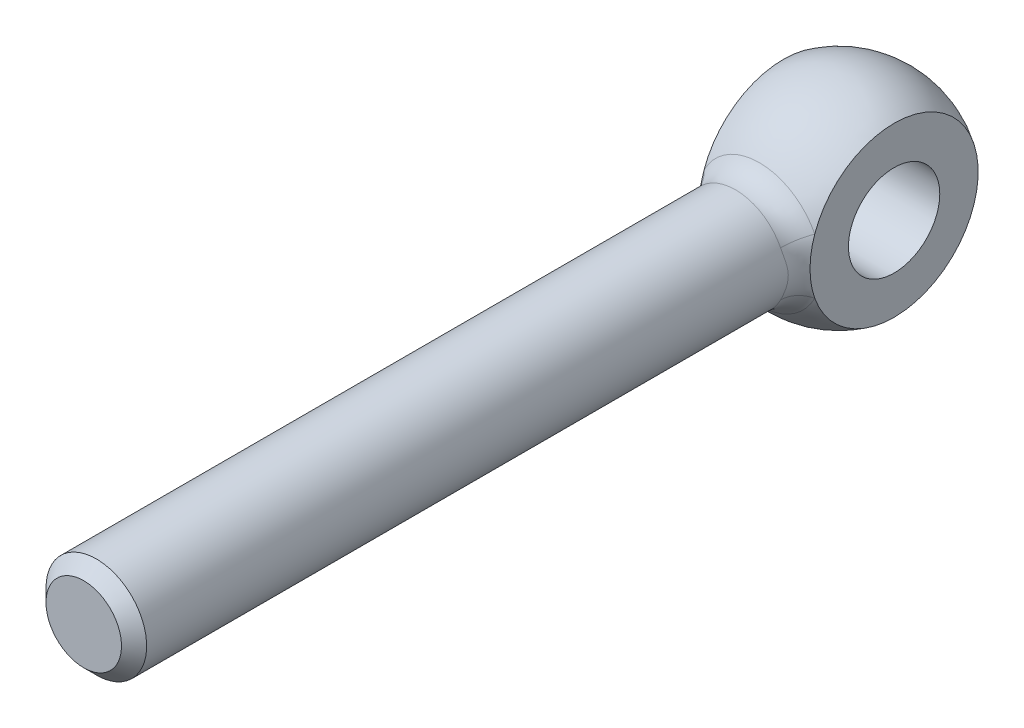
ISO-10303-21;
HEADER;
FILE_DESCRIPTION(('STEP AP214'),'2;1');
FILE_NAME('part.step','',(''),(''),'','','');
FILE_SCHEMA(('AUTOMOTIVE_DESIGN { 1 0 10303 214 1 1 1 1 }'));
ENDSEC;
DATA;
#1=APPLICATION_CONTEXT('core data for automotive mechanical design processes');
#2=APPLICATION_PROTOCOL_DEFINITION('international standard','automotive_design',2000,#1);
#3=PRODUCT_CONTEXT('',#1,'mechanical');
#4=PRODUCT('Part','Part','',(#3));
#5=PRODUCT_RELATED_PRODUCT_CATEGORY('part','',(#4));
#6=PRODUCT_DEFINITION_FORMATION('','',#4);
#7=PRODUCT_DEFINITION_CONTEXT('part definition',#1,'design');
#8=PRODUCT_DEFINITION('design','',#6,#7);
#9=PRODUCT_DEFINITION_SHAPE('','',#8);
#10=(LENGTH_UNIT() NAMED_UNIT(*) SI_UNIT(.MILLI.,.METRE.));
#11=(NAMED_UNIT(*) PLANE_ANGLE_UNIT() SI_UNIT($,.RADIAN.));
#12=(NAMED_UNIT(*) SI_UNIT($,.STERADIAN.) SOLID_ANGLE_UNIT());
#13=UNCERTAINTY_MEASURE_WITH_UNIT(LENGTH_MEASURE(1.E-05),#10,'distance_accuracy_value','');
#14=(GEOMETRIC_REPRESENTATION_CONTEXT(3) GLOBAL_UNCERTAINTY_ASSIGNED_CONTEXT((#13)) GLOBAL_UNIT_ASSIGNED_CONTEXT((#10,
#11,#12)) REPRESENTATION_CONTEXT('',''));
#15=CARTESIAN_POINT('',(0.,0.,0.));
#16=DIRECTION('',(0.,0.,1.));
#17=DIRECTION('',(1.,0.,0.));
#18=AXIS2_PLACEMENT_3D('',#15,#16,#17);
#19=CARTESIAN_POINT('',(0.,0.,0.));
#20=DIRECTION('',(1.,0.,0.));
#21=DIRECTION('',(0.,0.,-1.));
#22=AXIS2_PLACEMENT_3D('',#19,#20,#21);
#23=SPHERICAL_SURFACE('',#22,20.);
#24=CARTESIAN_POINT('',(-11.,0.,0.));
#25=DIRECTION('',(-1.,0.,0.));
#26=DIRECTION('',(0.,0.,1.));
#27=AXIS2_PLACEMENT_3D('',#24,#25,#26);
#28=CIRCLE('',#27,16.70329308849);
#29=CARTESIAN_POINT('',(-11.,-5.52080518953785,15.7645396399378));
#30=VERTEX_POINT('',#29);
#31=CARTESIAN_POINT('',(-11.,5.52080518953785,15.7645396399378));
#32=VERTEX_POINT('',#31);
#33=EDGE_CURVE('E249',#30,#32,#28,.F.);
#34=ORIENTED_EDGE('',*,*,#33,.T.);
#35=CARTESIAN_POINT('',(0.,0.,15.7645396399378));
#36=DIRECTION('',(0.,0.,-1.));
#37=DIRECTION('',(-1.,0.,0.));
#38=AXIS2_PLACEMENT_3D('',#35,#36,#37);
#39=CIRCLE('',#38,12.3076923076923);
#40=CARTESIAN_POINT('',(11.,5.52080518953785,15.7645396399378));
#41=VERTEX_POINT('',#40);
#42=EDGE_CURVE('E72',#32,#41,#39,.T.);
#43=ORIENTED_EDGE('',*,*,#42,.T.);
#44=CARTESIAN_POINT('',(11.,0.,0.));
#45=DIRECTION('',(-1.,0.,0.));
#46=DIRECTION('',(0.,0.,1.));
#47=AXIS2_PLACEMENT_3D('',#44,#45,#46);
#48=CIRCLE('',#47,16.70329308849);
#49=CARTESIAN_POINT('',(11.,-5.52080518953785,15.7645396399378));
#50=VERTEX_POINT('',#49);
#51=EDGE_CURVE('E60',#50,#41,#48,.F.);
#52=ORIENTED_EDGE('',*,*,#51,.F.);
#53=CARTESIAN_POINT('',(0.,0.,15.7645396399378));
#54=DIRECTION('',(0.,0.,-1.));
#55=DIRECTION('',(-1.,0.,0.));
#56=AXIS2_PLACEMENT_3D('',#53,#54,#55);
#57=CIRCLE('',#56,12.3076923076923);
#58=EDGE_CURVE('E69',#50,#30,#57,.T.);
#59=ORIENTED_EDGE('',*,*,#58,.T.);
#60=EDGE_LOOP('',(#34,#43,#52,#59));
#61=FACE_BOUND('',#60,.T.);
#62=ADVANCED_FACE('F14',(#61),#23,.T.);
#63=CARTESIAN_POINT('',(0.,0.,-10.));
#64=DIRECTION('',(0.,0.,-1.));
#65=DIRECTION('',(-1.,0.,0.));
#66=AXIS2_PLACEMENT_3D('',#63,#64,#65);
#67=CYLINDRICAL_SURFACE('',#66,10.);
#68=CARTESIAN_POINT('',(-11.,-8.07832612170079,14.6198716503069));
#69=CARTESIAN_POINT('',(-8.08765755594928,-5.9971977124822,16.1346742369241));
#70=CARTESIAN_POINT('',(-7.28375150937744,-6.8517854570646,19.8401938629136));
#71=CARTESIAN_POINT('',(-11.,-7.94371141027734,14.6942392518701));
#72=CARTESIAN_POINT('',(-8.11920288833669,-5.93544806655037,16.2397826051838));
#73=CARTESIAN_POINT('',(-7.39683409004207,-6.73162150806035,19.9238227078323));
#74=CARTESIAN_POINT('',(-11.,-7.80678493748,14.7674864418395));
#75=CARTESIAN_POINT('',(-8.15519368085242,-5.86983189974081,16.3423149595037));
#76=CARTESIAN_POINT('',(-7.50807818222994,-6.60735770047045,19.9985173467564));
#77=CARTESIAN_POINT('',(-11.,-7.52777860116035,14.9116503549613));
#78=CARTESIAN_POINT('',(-8.23492168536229,-5.72986071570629,16.5404699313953));
#79=CARTESIAN_POINT('',(-7.72578328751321,-6.3514024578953,20.1309394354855));
#80=CARTESIAN_POINT('',(-11.,-7.38570047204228,14.9825678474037));
#81=CARTESIAN_POINT('',(-8.27858235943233,-5.6556001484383,16.6361171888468));
#82=CARTESIAN_POINT('',(-7.83224588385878,-6.2197135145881,20.1886725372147));
#83=CARTESIAN_POINT('',(-11.,-7.09641260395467,15.1217242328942));
#84=CARTESIAN_POINT('',(-8.37244720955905,-5.49738599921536,16.8193360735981));
#85=CARTESIAN_POINT('',(-8.03890108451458,-5.95019585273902,20.2879075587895));
#86=CARTESIAN_POINT('',(-11.,-6.94922832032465,15.1899735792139));
#87=CARTESIAN_POINT('',(-8.42255486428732,-5.41357855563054,16.9069775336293));
#88=CARTESIAN_POINT('',(-8.13911932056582,-5.81239684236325,20.3294800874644));
#89=CARTESIAN_POINT('',(-11.,-6.64863682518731,15.3239259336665));
#90=CARTESIAN_POINT('',(-8.52797993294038,-5.23504745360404,17.0738797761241));
#91=CARTESIAN_POINT('',(-8.3329585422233,-5.5309117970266,20.3979224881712));
#92=CARTESIAN_POINT('',(-11.,-6.49523086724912,15.3896294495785));
#93=CARTESIAN_POINT('',(-8.58324700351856,-5.14042645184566,17.1531990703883));
#94=CARTESIAN_POINT('',(-8.42658084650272,-5.38722694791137,20.4247953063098));
#95=CARTESIAN_POINT('',(-11.,-6.20709411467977,15.5078088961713));
#96=CARTESIAN_POINT('',(-8.68811994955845,-4.95575537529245,17.290828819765));
#97=CARTESIAN_POINT('',(-8.59200338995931,-5.11841729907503,20.4619167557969));
#98=CARTESIAN_POINT('',(-11.,-6.07336532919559,15.5607030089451));
#99=CARTESIAN_POINT('',(-8.73711538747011,-4.8676122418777,17.3504312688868));
#100=CARTESIAN_POINT('',(-8.66488139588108,-4.99405789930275,20.4741536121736));
#101=CARTESIAN_POINT('',(-11.,-5.80091130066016,15.6643118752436));
#102=CARTESIAN_POINT('',(-8.8364756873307,-4.68301353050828,17.4631108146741));
#103=CARTESIAN_POINT('',(-8.80526889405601,-4.74215537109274,20.4901477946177));
#104=CARTESIAN_POINT('',(-11.,-5.66218619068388,15.7150266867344));
#105=CARTESIAN_POINT('',(-8.8868350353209,-4.58660687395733,17.5162358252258));
#106=CARTESIAN_POINT('',(-8.87277852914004,-4.61461232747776,20.4939053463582));
#107=CARTESIAN_POINT('',(-11.,-5.27448741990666,15.8508024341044));
#108=CARTESIAN_POINT('',(-9.02498244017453,-4.31134076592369,17.6524759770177));
#109=CARTESIAN_POINT('',(-9.05025948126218,-4.26097993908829,20.4938948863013));
#110=CARTESIAN_POINT('',(-11.,-5.02010807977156,15.9334171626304));
#111=CARTESIAN_POINT('',(-9.11341689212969,-4.12339116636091,17.7293699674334));
#112=CARTESIAN_POINT('',(-9.15455589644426,-4.03201043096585,20.482471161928));
#113=CARTESIAN_POINT('',(-11.,-4.49398867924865,16.0897301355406));
#114=CARTESIAN_POINT('',(-9.28526060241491,-3.72252236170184,17.863171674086));
#115=CARTESIAN_POINT('',(-9.3454636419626,-3.56728408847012,20.4426249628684));
#116=CARTESIAN_POINT('',(-11.,-4.22223625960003,16.1634219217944));
#117=CARTESIAN_POINT('',(-9.36879764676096,-3.50966167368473,17.9203351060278));
#118=CARTESIAN_POINT('',(-9.43206219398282,-3.33152248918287,20.4141902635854));
#119=CARTESIAN_POINT('',(-11.,-3.65988605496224,16.299975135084));
#120=CARTESIAN_POINT('',(-9.52556401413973,-3.06031940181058,18.0164117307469));
#121=CARTESIAN_POINT('',(-9.58737307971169,-2.8540318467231,20.3472388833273));
#122=CARTESIAN_POINT('',(-11.,-3.36923757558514,16.3628056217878));
#123=CARTESIAN_POINT('',(-9.59896836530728,-2.8236779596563,18.0555089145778));
#124=CARTESIAN_POINT('',(-9.65603459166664,-2.61228792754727,20.3086941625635));
#125=CARTESIAN_POINT('',(-11.,-2.76973253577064,16.4748716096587));
#126=CARTESIAN_POINT('',(-9.73032738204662,-2.33005694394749,18.1181298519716));
#127=CARTESIAN_POINT('',(-9.77497001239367,-2.12438390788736,20.2300406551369));
#128=CARTESIAN_POINT('',(-11.,-2.46087520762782,16.5241065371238));
#129=CARTESIAN_POINT('',(-9.78851479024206,-2.07279105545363,18.1418261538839));
#130=CARTESIAN_POINT('',(-9.82524314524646,-1.87822362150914,20.1899318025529));
#131=CARTESIAN_POINT('',(-11.,-1.97558099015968,16.5869215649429));
#132=CARTESIAN_POINT('',(-9.86272425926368,-1.66606653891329,18.1691299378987));
#133=CARTESIAN_POINT('',(-9.88798469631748,-1.49853407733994,20.1346921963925));
#134=CARTESIAN_POINT('',(-11.,-1.8048683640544,16.6064011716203));
#135=CARTESIAN_POINT('',(-9.88572783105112,-1.52271728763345,18.1769526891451));
#136=CARTESIAN_POINT('',(-9.90713175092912,-1.36624599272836,20.1166604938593));
#137=CARTESIAN_POINT('',(-11.,-1.45962748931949,16.6402989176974));
#138=CARTESIAN_POINT('',(-9.92572316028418,-1.23236071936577,18.1898667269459));
#139=CARTESIAN_POINT('',(-9.94012224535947,-1.10083909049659,20.0843097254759));
#140=CARTESIAN_POINT('',(-11.,-1.28509972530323,16.6547176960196));
#141=CARTESIAN_POINT('',(-9.94274289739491,-1.08526382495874,18.194968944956));
#142=CARTESIAN_POINT('',(-9.95396635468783,-0.96772037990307,20.0699901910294));
#143=CARTESIAN_POINT('',(-11.,-0.933265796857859,16.6781317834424));
#144=CARTESIAN_POINT('',(-9.97034914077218,-0.788518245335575,18.2029399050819));
#145=CARTESIAN_POINT('',(-9.97630347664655,-0.700915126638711,20.0463030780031));
#146=CARTESIAN_POINT('',(-11.,-0.755960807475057,16.6871293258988));
#147=CARTESIAN_POINT('',(-9.98095837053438,-0.638767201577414,18.2058159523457));
#148=CARTESIAN_POINT('',(-9.98479869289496,-0.567228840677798,20.0369334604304));
#149=CARTESIAN_POINT('',(-11.,-0.399779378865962,16.6994587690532));
#150=CARTESIAN_POINT('',(-9.99548246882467,-0.337908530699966,18.2096928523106));
#151=CARTESIAN_POINT('',(-9.99641148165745,-0.29951215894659,20.024007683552));
#152=CARTESIAN_POINT('',(-11.,-0.220902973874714,16.7027907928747));
#153=CARTESIAN_POINT('',(-9.99940850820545,-0.186688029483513,18.2106967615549));
#154=CARTESIAN_POINT('',(-9.99952917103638,-0.16548177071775,20.0204513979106));
#155=CARTESIAN_POINT('',(-11.,0.136946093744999,16.7036898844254));
#156=CARTESIAN_POINT('',(-10.0004672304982,0.115727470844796,18.2109707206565));
#157=CARTESIAN_POINT('',(-10.0003719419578,0.102589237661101,20.0194964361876));
#158=CARTESIAN_POINT('',(-11.,0.315918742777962,16.7012576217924));
#159=CARTESIAN_POINT('',(-9.9976015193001,0.2670390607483,18.210241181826));
#160=CARTESIAN_POINT('',(-9.99809764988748,0.236629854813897,20.0220970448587));
#161=CARTESIAN_POINT('',(-11.,0.67251250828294,16.6907025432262));
#162=CARTESIAN_POINT('',(-9.98516890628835,0.56828687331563,18.2069499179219));
#163=CARTESIAN_POINT('',(-9.98816894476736,0.504415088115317,20.0332017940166));
#164=CARTESIAN_POINT('',(-11.,0.850133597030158,16.6825796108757));
#165=CARTESIAN_POINT('',(-9.97559239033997,0.718336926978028,18.2043856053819));
#166=CARTESIAN_POINT('',(-9.98051442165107,0.638159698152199,20.0417060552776));
#167=CARTESIAN_POINT('',(-11.,1.20278271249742,16.6608685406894));
#168=CARTESIAN_POINT('',(-9.94999783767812,1.0158625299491,18.1971047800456));
#169=CARTESIAN_POINT('',(-9.95985376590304,0.905121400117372,20.0638261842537));
#170=CARTESIAN_POINT('',(-11.,1.3778096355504,16.6472781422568));
#171=CARTESIAN_POINT('',(-9.93395835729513,1.16344227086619,18.1923815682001));
#172=CARTESIAN_POINT('',(-9.94684541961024,1.03833825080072,20.0774441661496));
#173=CARTESIAN_POINT('',(-11.,1.72418294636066,16.6149773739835));
#174=CARTESIAN_POINT('',(-9.89585032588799,1.4549136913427,18.1803094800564));
#175=CARTESIAN_POINT('',(-9.91552061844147,1.30397158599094,20.1086007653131));
#176=CARTESIAN_POINT('',(-11.,1.89552887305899,16.5962663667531));
#177=CARTESIAN_POINT('',(-9.87375477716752,1.59889725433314,18.1729504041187));
#178=CARTESIAN_POINT('',(-9.89720350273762,1.43638796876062,20.1261398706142));
#179=CARTESIAN_POINT('',(-11.,2.37500909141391,16.5365375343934));
#180=CARTESIAN_POINT('',(-9.80319058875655,2.00106699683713,18.1475319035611));
#181=CARTESIAN_POINT('',(-9.83780774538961,1.81042123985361,20.1794292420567));
#182=CARTESIAN_POINT('',(-11.,2.67790728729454,16.489938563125));
#183=CARTESIAN_POINT('',(-9.74810406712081,2.25372441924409,18.1256509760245));
#184=CARTESIAN_POINT('',(-9.79049373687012,2.05090574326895,20.2181580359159));
#185=CARTESIAN_POINT('',(-11.,3.26643446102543,16.3835279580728));
#186=CARTESIAN_POINT('',(-9.62321822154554,2.73944425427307,18.0677502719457));
#187=CARTESIAN_POINT('',(-9.67835774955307,2.52772088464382,20.2950790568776));
#188=CARTESIAN_POINT('',(-11.,3.55206644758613,16.3237186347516));
#189=CARTESIAN_POINT('',(-9.55320446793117,2.97279590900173,18.0315791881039));
#190=CARTESIAN_POINT('',(-9.61353883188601,2.76405224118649,20.3332713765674));
#191=CARTESIAN_POINT('',(-11.,4.10520079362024,16.1934500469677));
#192=CARTESIAN_POINT('',(-9.40307308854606,3.41694854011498,17.9425152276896));
#193=CARTESIAN_POINT('',(-9.46676566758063,3.23111087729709,20.4009956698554));
#194=CARTESIAN_POINT('',(-11.,4.37275328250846,16.1230221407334));
#195=CARTESIAN_POINT('',(-9.32279049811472,3.62792393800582,17.8894603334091));
#196=CARTESIAN_POINT('',(-9.38486161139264,3.46185240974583,20.4305524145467));
#197=CARTESIAN_POINT('',(-11.,4.89128593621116,15.9733573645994));
#198=CARTESIAN_POINT('',(-9.15681833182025,4.02651224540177,17.7649594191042));
#199=CARTESIAN_POINT('',(-9.20410009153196,3.91720598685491,20.4744658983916));
#200=CARTESIAN_POINT('',(-11.,5.14226890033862,15.8941219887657));
#201=CARTESIAN_POINT('',(-9.0709959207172,4.21407941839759,17.693269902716));
#202=CARTESIAN_POINT('',(-9.10524550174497,4.14181906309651,20.4888252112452));
#203=CARTESIAN_POINT('',(-11.,5.57948076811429,15.7452016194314));
#204=CARTESIAN_POINT('',(-8.91675575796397,4.52930004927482,17.547612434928));
#205=CARTESIAN_POINT('',(-8.91288683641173,4.53858237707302,20.4959451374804));
#206=CARTESIAN_POINT('',(-11.,5.76853191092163,15.6768309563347));
#207=CARTESIAN_POINT('',(-8.84816828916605,4.66157604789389,17.4767712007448));
#208=CARTESIAN_POINT('',(-8.82235160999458,4.71214727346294,20.4924900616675));
#209=CARTESIAN_POINT('',(-11.,6.13738931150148,15.536131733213));
#210=CARTESIAN_POINT('',(-8.71360068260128,4.91098552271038,17.3233243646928));
#211=CARTESIAN_POINT('',(-8.63145758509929,5.05332990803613,20.4699143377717));
#212=CARTESIAN_POINT('',(-11.,6.31719880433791,15.4638045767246));
#213=CARTESIAN_POINT('',(-8.64763428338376,5.0280023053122,17.2406040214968));
#214=CARTESIAN_POINT('',(-8.53110226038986,5.22094972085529,20.4507992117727));
#215=CARTESIAN_POINT('',(-11.,6.67039350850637,15.3147992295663));
#216=CARTESIAN_POINT('',(-8.52017906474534,5.24885941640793,17.0629563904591));
#217=CARTESIAN_POINT('',(-8.32005997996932,5.55115938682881,20.3943977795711));
#218=CARTESIAN_POINT('',(-11.,6.84367796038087,15.2380797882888));
#219=CARTESIAN_POINT('',(-8.45881409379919,5.35236860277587,16.9678049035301));
#220=CARTESIAN_POINT('',(-8.20926514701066,5.71366661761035,20.3568998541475));
#221=CARTESIAN_POINT('',(-11.,7.18254092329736,15.0813064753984));
#222=CARTESIAN_POINT('',(-8.34361214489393,5.54600465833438,16.7669351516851));
#223=CARTESIAN_POINT('',(-7.97938823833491,6.03058739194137,20.2617246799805));
#224=CARTESIAN_POINT('',(-11.,7.34810983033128,15.0012486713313));
#225=CARTESIAN_POINT('',(-8.28987110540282,5.63596246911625,16.6611306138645));
#226=CARTESIAN_POINT('',(-7.86029627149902,6.18499087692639,20.2040230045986));
#227=CARTESIAN_POINT('',(-11.,7.51010721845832,14.9197282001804));
#228=CARTESIAN_POINT('',(-8.24137694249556,5.71943183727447,16.551178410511));
#229=CARTESIAN_POINT('',(-7.73770382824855,6.3346617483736,20.1353038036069));
#230=(BOUNDED_SURFACE() B_SPLINE_SURFACE(3,2,((#68,#69,#70),(#71,#72,#73),(#74,#75,#76),(#77,
#78,#79),(#80,#81,#82),(#83,#84,#85),(#86,#87,#88),(#89,#90,#91),(#92,#93,#94),(#95,#96,#97),
(#98,#99,#100),(#101,#102,#103),(#104,#105,#106),(#107,#108,#109),(#110,#111,#112),(#113,#114,
#115),(#116,#117,#118),(#119,#120,#121),(#122,#123,#124),(#125,#126,#127),(#128,#129,#130),
(#131,#132,#133),(#134,#135,#136),(#137,#138,#139),(#140,#141,#142),(#143,#144,#145),(#146,#147,
#148),(#149,#150,#151),(#152,#153,#154),(#155,#156,#157),(#158,#159,#160),(#161,#162,#163),
(#164,#165,#166),(#167,#168,#169),(#170,#171,#172),(#173,#174,#175),(#176,#177,#178),(#179,#180,
#181),(#182,#183,#184),(#185,#186,#187),(#188,#189,#190),(#191,#192,#193),(#194,#195,#196),
(#197,#198,#199),(#200,#201,#202),(#203,#204,#205),(#206,#207,#208),(#209,#210,#211),(#212,#213,
#214),(#215,#216,#217),(#218,#219,#220),(#221,#222,#223),(#224,#225,#226),(#227,#228,#229)),
.UNSPECIFIED.,.F.,.F.,.F.) B_SPLINE_SURFACE_WITH_KNOTS((4,2,2,2,2,2,2,2,2,2,2,2,2,2,2,2,2,2,2,2,
2,2,2,2,2,2,4),(3,3),(0.,0.830487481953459,1.66069791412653,2.48723908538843,3.31361454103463,
4.00607990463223,4.69852683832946,5.90492644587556,7.11219405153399,8.32284604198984,
9.53354911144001,10.1772580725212,10.8208857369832,11.4642480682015,12.1075964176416,
12.750870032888,13.3941568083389,14.0377098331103,14.6813430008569,15.862356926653,
17.0431644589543,18.220550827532,19.3977377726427,20.336589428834,21.2751101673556,
22.2246980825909,23.1754380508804),(0.,1.),
.UNSPECIFIED.) GEOMETRIC_REPRESENTATION_ITEM() RATIONAL_B_SPLINE_SURFACE(((1.,0.839284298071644,
1.),(1.,0.842507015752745,1.),(1.,0.845813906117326,1.),(1.,0.852563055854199,1.),(1.,
0.856005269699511,1.),(1.,0.862978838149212,1.),(1.,0.866509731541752,1.),(1.,0.873627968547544,
1.),(1.,0.877215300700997,1.),(1.,0.883811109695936,1.),(1.,0.886819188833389,1.),(1.,
0.892802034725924,1.),(1.,0.895776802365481,1.),(1.,0.90383958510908,1.),(1.,0.908857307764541,
1.),(1.,0.918479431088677,1.),(1.,0.92308353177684,1.),(1.,0.931678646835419,1.),(1.,
0.935667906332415,1.),(1.,0.942805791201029,1.),(1.,0.945954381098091,1.),(1.,0.949974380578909,
1.),(1.,0.951221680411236,1.),(1.,0.95339250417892,1.),(1.,0.954316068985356,1.),(1.,
0.955815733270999,1.),(1.,0.956391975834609,1.),(1.,0.957181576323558,1.),(1.,0.957394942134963,
1.),(1.,0.957452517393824,1.),(1.,0.95729676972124,1.),(1.,0.956620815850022,1.),(1.,
0.956100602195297,1.),(1.,0.954710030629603,1.),(1.,0.953839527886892,1.),(1.,0.951770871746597,
1.),(1.,0.950572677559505,1.),(1.,0.946749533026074,1.),(1.,0.943768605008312,1.),(1.,
0.936985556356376,1.),(1.,0.933183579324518,1.),(1.,0.924966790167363,1.),(1.,0.920553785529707,
1.),(1.,0.911300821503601,1.),(1.,0.906460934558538,1.),(1.,0.897549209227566,1.),(1.,
0.893520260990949,1.),(1.,0.885405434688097,1.),(1.,0.881319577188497,1.),(1.,0.873128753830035,
1.),(1.,0.869024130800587,1.),(1.,0.860913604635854,1.),(1.,0.856907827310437,1.),(1.,
0.852991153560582,1.))) REPRESENTATION_ITEM('') SURFACE());
#231=CARTESIAN_POINT('',(-7.73770382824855,6.3346617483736,20.1353038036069));
#232=CARTESIAN_POINT('',(-7.86029627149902,6.18499087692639,20.2040230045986));
#233=CARTESIAN_POINT('',(-7.97938823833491,6.03058739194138,20.2617246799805));
#234=CARTESIAN_POINT('',(-8.20926514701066,5.71366661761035,20.3568998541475));
#235=CARTESIAN_POINT('',(-8.32005997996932,5.55115938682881,20.3943977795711));
#236=CARTESIAN_POINT('',(-8.53110226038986,5.22094972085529,20.4507992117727));
#237=CARTESIAN_POINT('',(-8.6314575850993,5.05332990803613,20.4699143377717));
#238=CARTESIAN_POINT('',(-8.82235160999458,4.71214727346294,20.4924900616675));
#239=CARTESIAN_POINT('',(-8.91288683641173,4.53858237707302,20.4959451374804));
#240=CARTESIAN_POINT('',(-9.10524550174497,4.14181906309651,20.4888252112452));
#241=CARTESIAN_POINT('',(-9.20410009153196,3.91720598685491,20.4744658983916));
#242=CARTESIAN_POINT('',(-9.38486161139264,3.46185240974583,20.4305524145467));
#243=CARTESIAN_POINT('',(-9.46676566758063,3.23111087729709,20.4009956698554));
#244=CARTESIAN_POINT('',(-9.61353883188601,2.76405224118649,20.3332713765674));
#245=CARTESIAN_POINT('',(-9.67835774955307,2.52772088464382,20.2950790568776));
#246=CARTESIAN_POINT('',(-9.79049373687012,2.05090574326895,20.2181580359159));
#247=CARTESIAN_POINT('',(-9.83780774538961,1.8104212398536,20.1794292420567));
#248=CARTESIAN_POINT('',(-9.89720350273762,1.43638796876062,20.1261398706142));
#249=CARTESIAN_POINT('',(-9.91552061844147,1.30397158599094,20.1086007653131));
#250=CARTESIAN_POINT('',(-9.94684541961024,1.03833825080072,20.0774441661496));
#251=CARTESIAN_POINT('',(-9.95985376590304,0.905121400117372,20.0638261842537));
#252=CARTESIAN_POINT('',(-9.98051442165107,0.638159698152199,20.0417060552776));
#253=CARTESIAN_POINT('',(-9.98816894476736,0.504415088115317,20.0332017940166));
#254=CARTESIAN_POINT('',(-9.99809764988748,0.236629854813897,20.0220970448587));
#255=CARTESIAN_POINT('',(-10.0003719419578,0.102589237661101,20.0194964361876));
#256=CARTESIAN_POINT('',(-9.99952917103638,-0.16548177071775,20.0204513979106));
#257=CARTESIAN_POINT('',(-9.99641148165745,-0.29951215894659,20.024007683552));
#258=CARTESIAN_POINT('',(-9.98479869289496,-0.567228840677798,20.0369334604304));
#259=CARTESIAN_POINT('',(-9.97630347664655,-0.700915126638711,20.0463030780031));
#260=CARTESIAN_POINT('',(-9.95396635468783,-0.96772037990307,20.0699901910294));
#261=CARTESIAN_POINT('',(-9.94012224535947,-1.10083909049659,20.0843097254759));
#262=CARTESIAN_POINT('',(-9.90713175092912,-1.36624599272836,20.1166604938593));
#263=CARTESIAN_POINT('',(-9.88798469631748,-1.49853407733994,20.1346921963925));
#264=CARTESIAN_POINT('',(-9.82524314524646,-1.87822362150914,20.1899318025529));
#265=CARTESIAN_POINT('',(-9.77497001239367,-2.12438390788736,20.2300406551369));
#266=CARTESIAN_POINT('',(-9.65603459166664,-2.61228792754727,20.3086941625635));
#267=CARTESIAN_POINT('',(-9.58737307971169,-2.8540318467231,20.3472388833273));
#268=CARTESIAN_POINT('',(-9.43206219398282,-3.33152248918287,20.4141902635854));
#269=CARTESIAN_POINT('',(-9.3454636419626,-3.56728408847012,20.4426249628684));
#270=CARTESIAN_POINT('',(-9.15455589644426,-4.03201043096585,20.482471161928));
#271=CARTESIAN_POINT('',(-9.05025948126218,-4.26097993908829,20.4938948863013));
#272=CARTESIAN_POINT('',(-8.87277852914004,-4.61461232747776,20.4939053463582));
#273=CARTESIAN_POINT('',(-8.80526889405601,-4.74215537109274,20.4901477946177));
#274=CARTESIAN_POINT('',(-8.66488139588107,-4.99405789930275,20.4741536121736));
#275=CARTESIAN_POINT('',(-8.59200338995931,-5.11841729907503,20.4619167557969));
#276=CARTESIAN_POINT('',(-8.42658084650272,-5.38722694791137,20.4247953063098));
#277=CARTESIAN_POINT('',(-8.3329585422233,-5.5309117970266,20.3979224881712));
#278=CARTESIAN_POINT('',(-8.13911932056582,-5.81239684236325,20.3294800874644));
#279=CARTESIAN_POINT('',(-8.03890108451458,-5.95019585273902,20.2879075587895));
#280=CARTESIAN_POINT('',(-7.83224588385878,-6.2197135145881,20.1886725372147));
#281=CARTESIAN_POINT('',(-7.72578328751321,-6.3514024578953,20.1309394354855));
#282=CARTESIAN_POINT('',(-7.50807818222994,-6.60735770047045,19.9985173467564));
#283=CARTESIAN_POINT('',(-7.39683409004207,-6.73162150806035,19.9238227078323));
#284=CARTESIAN_POINT('',(-7.28375150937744,-6.8517854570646,19.8401938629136));
#285=B_SPLINE_CURVE_WITH_KNOTS('',3,(#231,#232,#233,#234,#235,#236,#237,#238,#239,#240,#241,
#242,#243,#244,#245,#246,#247,#248,#249,#250,#251,#252,#253,#254,#255,#256,#257,#258,#259,#260,
#261,#262,#263,#264,#265,#266,#267,#268,#269,#270,#271,#272,#273,#274,#275,#276,#277,#278,#279,
#280,#281,#282,#283,#284),.UNSPECIFIED.,.F.,.F.,(4,2,2,2,2,2,2,2,2,2,2,2,2,2,2,2,2,2,2,2,2,2,2,
2,2,2,4),(0.,0.950739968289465,1.90032788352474,2.83884862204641,3.77770027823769,
4.9548872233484,6.13227359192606,7.31308112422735,8.49409505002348,9.13772821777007,
9.78128124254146,10.4245680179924,11.0678416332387,11.7111899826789,12.3545523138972,
12.9981799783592,13.6418889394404,14.8525920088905,16.0632439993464,17.2705116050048,
18.4769112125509,19.1693581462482,19.8618235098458,20.688198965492,21.5147401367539,
22.3449505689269,23.1754380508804),.UNSPECIFIED.);
#286=CARTESIAN_POINT('',(-8.9375,4.4856542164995,20.4939015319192));
#287=VERTEX_POINT('',#286);
#288=CARTESIAN_POINT('',(-8.9375,-4.48565421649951,20.4939015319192));
#289=VERTEX_POINT('',#288);
#290=EDGE_CURVE('E85',#287,#289,#285,.T.);
#291=ORIENTED_EDGE('',*,*,#290,.T.);
#292=CARTESIAN_POINT('',(0.,0.,20.4939015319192));
#293=DIRECTION('',(0.,0.,-1.));
#294=DIRECTION('',(-1.,0.,0.));
#295=AXIS2_PLACEMENT_3D('',#292,#293,#294);
#296=CIRCLE('',#295,10.);
#297=CARTESIAN_POINT('',(8.9375,-4.4856542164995,20.4939015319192));
#298=VERTEX_POINT('',#297);
#299=EDGE_CURVE('E9',#289,#298,#296,.F.);
#300=ORIENTED_EDGE('',*,*,#299,.T.);
#301=CARTESIAN_POINT('',(11.,8.07832621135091,14.61987160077));
#302=CARTESIAN_POINT('',(8.08765753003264,5.9971977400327,16.1346741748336));
#303=CARTESIAN_POINT('',(7.28375150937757,6.85178545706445,19.8401938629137));
#304=CARTESIAN_POINT('',(11.,7.94371144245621,14.6942392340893));
#305=CARTESIAN_POINT('',(8.11920287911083,5.93544807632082,16.2397825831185));
#306=CARTESIAN_POINT('',(7.39683409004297,6.73162150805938,19.9238227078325));
#307=CARTESIAN_POINT('',(11.,7.80678494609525,14.7674864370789));
#308=CARTESIAN_POINT('',(8.15519367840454,5.86983190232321,16.3423149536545));
#309=CARTESIAN_POINT('',(7.50807818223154,6.60735770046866,19.998517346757));
#310=CARTESIAN_POINT('',(11.,7.52777859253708,14.911650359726));
#311=CARTESIAN_POINT('',(8.23492168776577,5.72986071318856,16.5404699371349));
#312=CARTESIAN_POINT('',(7.72578328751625,6.35140245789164,20.1309394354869));
#313=CARTESIAN_POINT('',(11.,7.38570046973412,14.9825678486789));
#314=CARTESIAN_POINT('',(8.2785823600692,5.65560014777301,16.6361171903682));
#315=CARTESIAN_POINT('',(7.83224588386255,6.21971351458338,20.1886725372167));
#316=CARTESIAN_POINT('',(11.,7.09641260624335,15.1217242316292));
#317=CARTESIAN_POINT('',(8.37244720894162,5.49738599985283,16.8193360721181));
#318=CARTESIAN_POINT('',(8.03890108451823,5.95019585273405,20.2879075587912));
#319=CARTESIAN_POINT('',(11.,6.94922832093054,15.1899735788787));
#320=CARTESIAN_POINT('',(8.422554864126,5.41357855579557,16.9069775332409));
#321=CARTESIAN_POINT('',(8.13911932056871,5.81239684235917,20.3294800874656));
#322=CARTESIAN_POINT('',(11.,6.6486368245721,15.3239259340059));
#323=CARTESIAN_POINT('',(8.52797993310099,5.23504745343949,17.0738797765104));
#324=CARTESIAN_POINT('',(8.33295854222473,5.5309117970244,20.3979224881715));
#325=CARTESIAN_POINT('',(11.,6.49523086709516,15.3896294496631));
#326=CARTESIAN_POINT('',(8.58324700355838,5.14042645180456,17.1531990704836));
#327=CARTESIAN_POINT('',(8.42658084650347,5.38722694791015,20.4247953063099));
#328=CARTESIAN_POINT('',(11.,6.20709411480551,15.5078088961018));
#329=CARTESIAN_POINT('',(8.68811994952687,4.95575537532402,17.2908288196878));
#330=CARTESIAN_POINT('',(8.59200338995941,5.11841729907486,20.4619167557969));
#331=CARTESIAN_POINT('',(11.,6.07336532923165,15.5607030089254));
#332=CARTESIAN_POINT('',(8.73711538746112,4.86761224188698,17.3504312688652));
#333=CARTESIAN_POINT('',(8.66488139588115,4.99405789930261,20.4741536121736));
#334=CARTESIAN_POINT('',(11.,5.8009113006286,15.6643118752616));
#335=CARTESIAN_POINT('',(8.83647568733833,4.6830135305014,17.4631108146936));
#336=CARTESIAN_POINT('',(8.80526889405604,4.74215537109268,20.4901477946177));
#337=CARTESIAN_POINT('',(11.,5.66218619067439,15.7150266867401));
#338=CARTESIAN_POINT('',(8.88683503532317,4.58660687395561,17.5162358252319));
#339=CARTESIAN_POINT('',(8.87277852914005,4.61461232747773,20.4939053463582));
#340=CARTESIAN_POINT('',(11.,5.27448741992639,15.8508024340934));
#341=CARTESIAN_POINT('',(9.02498244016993,4.31134076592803,17.6524759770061));
#342=CARTESIAN_POINT('',(9.05025948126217,4.26097993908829,20.4938948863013));
#343=CARTESIAN_POINT('',(11.,5.02010807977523,15.9334171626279));
#344=CARTESIAN_POINT('',(9.11341689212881,4.12339116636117,17.7293699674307));
#345=CARTESIAN_POINT('',(9.15455589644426,4.03201043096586,20.482471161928));
#346=CARTESIAN_POINT('',(11.,4.49398867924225,16.0897301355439));
#347=CARTESIAN_POINT('',(9.28526060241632,3.72252236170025,17.8631716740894));
#348=CARTESIAN_POINT('',(9.3454636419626,3.56728408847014,20.4426249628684));
#349=CARTESIAN_POINT('',(11.,4.22223625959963,16.163421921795));
#350=CARTESIAN_POINT('',(9.36879764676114,3.50966167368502,17.9203351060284));
#351=CARTESIAN_POINT('',(9.43206219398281,3.33152248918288,20.4141902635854));
#352=CARTESIAN_POINT('',(11.,3.65988605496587,16.2999751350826));
#353=CARTESIAN_POINT('',(9.52556401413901,3.06031940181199,18.0164117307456));
#354=CARTESIAN_POINT('',(9.58737307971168,2.85403184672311,20.3472388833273));
#355=CARTESIAN_POINT('',(11.,3.3692375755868,16.3628056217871));
#356=CARTESIAN_POINT('',(9.59896836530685,2.82367795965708,18.0555089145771));
#357=CARTESIAN_POINT('',(9.65603459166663,2.61228792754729,20.3086941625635));
#358=CARTESIAN_POINT('',(11.,2.76973253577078,16.4748716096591));
#359=CARTESIAN_POINT('',(9.73032738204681,2.33005694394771,18.118129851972));
#360=CARTESIAN_POINT('',(9.77497001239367,2.12438390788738,20.2300406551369));
#361=CARTESIAN_POINT('',(11.,2.46087520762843,16.5241065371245));
#362=CARTESIAN_POINT('',(9.78851479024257,2.07279105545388,18.1418261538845));
#363=CARTESIAN_POINT('',(9.82524314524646,1.87822362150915,20.1899318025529));
#364=CARTESIAN_POINT('',(11.,1.97558099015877,16.5869215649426));
#365=CARTESIAN_POINT('',(9.86272425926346,1.66606653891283,18.1691299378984));
#366=CARTESIAN_POINT('',(9.88798469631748,1.49853407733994,20.1346921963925));
#367=CARTESIAN_POINT('',(11.,1.80486836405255,16.6064011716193));
#368=CARTESIAN_POINT('',(9.88572783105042,1.52271728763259,18.1769526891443));
#369=CARTESIAN_POINT('',(9.90713175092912,1.36624599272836,20.1166604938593));
#370=CARTESIAN_POINT('',(11.,1.45962748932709,16.6402989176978));
#371=CARTESIAN_POINT('',(9.92572316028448,1.23236071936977,18.1898667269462));
#372=CARTESIAN_POINT('',(9.94012224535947,1.10083909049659,20.0843097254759));
#373=CARTESIAN_POINT('',(11.,1.28509972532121,16.6547176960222));
#374=CARTESIAN_POINT('',(9.94274289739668,1.08526382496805,18.194968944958));
#375=CARTESIAN_POINT('',(9.95396635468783,0.96772037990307,20.0699901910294));
#376=CARTESIAN_POINT('',(11.,0.933265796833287,16.6781317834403));
#377=CARTESIAN_POINT('',(9.97034914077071,0.788518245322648,18.2029399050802));
#378=CARTESIAN_POINT('',(9.97630347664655,0.700915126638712,20.0463030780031));
#379=CARTESIAN_POINT('',(11.,0.755960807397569,16.6871293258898));
#380=CARTESIAN_POINT('',(9.98095837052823,0.638767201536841,18.2058159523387));
#381=CARTESIAN_POINT('',(9.98479869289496,0.567228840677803,20.0369334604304));
#382=CARTESIAN_POINT('',(11.,0.399779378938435,16.6994587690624));
#383=CARTESIAN_POINT('',(9.99548246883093,0.337908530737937,18.2096928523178));
#384=CARTESIAN_POINT('',(9.99641148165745,0.299512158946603,20.024007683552));
#385=CARTESIAN_POINT('',(11.,0.220902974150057,16.702790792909));
#386=CARTESIAN_POINT('',(9.99940850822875,0.186688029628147,18.2106967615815));
#387=CARTESIAN_POINT('',(9.99952917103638,0.165481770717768,20.0204513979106));
#388=CARTESIAN_POINT('',(11.,-0.136946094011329,16.703689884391));
#389=CARTESIAN_POINT('',(10.0004672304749,-0.115727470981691,18.2109707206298));
#390=CARTESIAN_POINT('',(10.0003719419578,-0.102589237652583,20.0194964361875));
#391=CARTESIAN_POINT('',(11.,-0.315918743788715,16.7012576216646));
#392=CARTESIAN_POINT('',(9.99760151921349,-0.267039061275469,18.2102411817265));
#393=CARTESIAN_POINT('',(9.99809764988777,-0.236629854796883,20.0220970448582));
#394=CARTESIAN_POINT('',(11.,-0.672512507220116,16.6907025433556));
#395=CARTESIAN_POINT('',(9.98516890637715,-0.568286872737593,18.2069499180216));
#396=CARTESIAN_POINT('',(9.98816894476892,-0.504415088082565,20.0332017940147));
#397=CARTESIAN_POINT('',(11.,-0.850133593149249,16.6825796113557));
#398=CARTESIAN_POINT('',(9.9755923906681,-0.718336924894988,18.2043856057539));
#399=CARTESIAN_POINT('',(9.98051442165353,-0.638159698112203,20.0417060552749));
#400=CARTESIAN_POINT('',(11.,-1.20278271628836,16.6608685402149));
#401=CARTESIAN_POINT('',(9.94999783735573,-1.01586253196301,18.1971047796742));
#402=CARTESIAN_POINT('',(9.95985376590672,-0.90512140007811,20.0638261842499));
#403=CARTESIAN_POINT('',(11.,-1.37780964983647,16.6472781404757));
#404=CARTESIAN_POINT('',(9.93395835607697,-1.16344227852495,18.1923815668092));
#405=CARTESIAN_POINT('',(9.94684541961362,-1.03833825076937,20.0774441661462));
#406=CARTESIAN_POINT('',(11.,-1.72418293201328,16.6149773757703));
#407=CARTESIAN_POINT('',(9.89585032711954,-1.4549136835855,18.1803094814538));
#408=CARTESIAN_POINT('',(9.91552061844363,-1.30397158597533,20.108600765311));
#409=CARTESIAN_POINT('',(11.,-1.89552881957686,16.596266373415));
#410=CARTESIAN_POINT('',(9.8737547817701,-1.59889722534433,18.1729504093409));
#411=CARTESIAN_POINT('',(9.89720350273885,-1.43638796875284,20.1261398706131));
#412=CARTESIAN_POINT('',(11.,-2.37500900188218,16.5365375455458));
#413=CARTESIAN_POINT('',(9.80319059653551,-2.00106694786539,18.1475319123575));
#414=CARTESIAN_POINT('',(9.83780774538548,-1.81042123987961,20.1794292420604));
#415=CARTESIAN_POINT('',(11.,-2.67790726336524,16.4899385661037));
#416=CARTESIAN_POINT('',(9.7481040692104,-2.25372440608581,18.125650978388));
#417=CARTESIAN_POINT('',(9.79049373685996,-2.05090574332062,20.2181580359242));
#418=CARTESIAN_POINT('',(11.,-3.26643448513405,16.3835279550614));
#419=CARTESIAN_POINT('',(9.62321821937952,-2.73944426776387,18.0677502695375));
#420=CARTESIAN_POINT('',(9.67835774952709,-2.52772088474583,20.2950790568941));
#421=CARTESIAN_POINT('',(11.,-3.55206645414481,16.3237186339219));
#422=CARTESIAN_POINT('',(9.55320446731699,-2.97279591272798,18.0315791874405));
#423=CARTESIAN_POINT('',(9.61353883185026,-2.76405224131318,20.3332713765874));
#424=CARTESIAN_POINT('',(11.,-4.10520078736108,16.1934500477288));
#425=CARTESIAN_POINT('',(9.40307308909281,-3.41694853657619,17.9425152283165));
#426=CARTESIAN_POINT('',(9.46676566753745,-3.23111087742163,20.4009956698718));
#427=CARTESIAN_POINT('',(11.,-4.37275328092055,16.1230221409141));
#428=CARTESIAN_POINT('',(9.32279049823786,-3.62792393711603,17.8894603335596));
#429=CARTESIAN_POINT('',(9.38486161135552,-3.46185240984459,20.4305524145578));
#430=CARTESIAN_POINT('',(11.,-4.89128593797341,15.9733573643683));
#431=CARTESIAN_POINT('',(9.15681833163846,-4.02651224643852,17.7649594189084));
#432=CARTESIAN_POINT('',(9.20410009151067,-3.91720598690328,20.4744658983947));
#433=CARTESIAN_POINT('',(11.,-5.1422689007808,15.8941219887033));
#434=CARTESIAN_POINT('',(9.07099592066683,-4.21407941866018,17.6932699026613));
#435=CARTESIAN_POINT('',(9.10524550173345,-4.14181906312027,20.4888252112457));
#436=CARTESIAN_POINT('',(11.,-5.57948076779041,15.7452016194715));
#437=CARTESIAN_POINT('',(8.91675575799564,-4.52930004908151,17.5476124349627));
#438=CARTESIAN_POINT('',(8.91288683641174,-4.538582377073,20.4959451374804));
#439=CARTESIAN_POINT('',(11.,-5.7685319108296,15.6768309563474));
#440=CARTESIAN_POINT('',(8.84816828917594,-4.66157604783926,17.4767712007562));
#441=CARTESIAN_POINT('',(8.82235160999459,-4.71214727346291,20.4924900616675));
#442=CARTESIAN_POINT('',(11.,-6.13738931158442,15.5361317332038));
#443=CARTESIAN_POINT('',(8.71360068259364,-4.91098552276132,17.3233243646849));
#444=CARTESIAN_POINT('',(8.63145758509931,-5.05332990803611,20.4699143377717));
#445=CARTESIAN_POINT('',(11.,-6.31719880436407,15.463804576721));
#446=CARTESIAN_POINT('',(8.64763428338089,-5.02800230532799,17.2406040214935));
#447=CARTESIAN_POINT('',(8.53110226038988,-5.22094972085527,20.4507992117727));
#448=CARTESIAN_POINT('',(11.,-6.67039350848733,15.3147992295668));
#449=CARTESIAN_POINT('',(8.52017906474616,-5.2488594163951,17.0629563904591));
#450=CARTESIAN_POINT('',(8.32005997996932,-5.5511593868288,20.3943977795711));
#451=CARTESIAN_POINT('',(11.,-6.84367796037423,15.2380797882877));
#452=CARTESIAN_POINT('',(8.45881409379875,-5.3523686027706,16.9678049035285));
#453=CARTESIAN_POINT('',(8.20926514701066,-5.71366661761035,20.3568998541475));
#454=CARTESIAN_POINT('',(11.,-7.18254092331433,15.0813064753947));
#455=CARTESIAN_POINT('',(8.34361214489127,-5.54600465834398,16.7669351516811));
#456=CARTESIAN_POINT('',(7.97938823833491,-6.03058739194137,20.2617246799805));
#457=CARTESIAN_POINT('',(11.,-7.34810983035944,15.0012486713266));
#458=CARTESIAN_POINT('',(8.28987110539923,-5.63596246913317,16.6611306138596));
#459=CARTESIAN_POINT('',(7.86029627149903,-6.18499087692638,20.2040230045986));
#460=CARTESIAN_POINT('',(11.,-7.51010721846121,14.919728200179));
#461=CARTESIAN_POINT('',(8.24137694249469,-5.71943183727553,16.5511784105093));
#462=CARTESIAN_POINT('',(7.73770382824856,-6.33466174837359,20.1353038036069));
#463=(BOUNDED_SURFACE() B_SPLINE_SURFACE(3,2,((#301,#302,#303),(#304,#305,#306),(#307,#308,
#309),(#310,#311,#312),(#313,#314,#315),(#316,#317,#318),(#319,#320,#321),(#322,#323,#324),
(#325,#326,#327),(#328,#329,#330),(#331,#332,#333),(#334,#335,#336),(#337,#338,#339),(#340,#341,
#342),(#343,#344,#345),(#346,#347,#348),(#349,#350,#351),(#352,#353,#354),(#355,#356,#357),
(#358,#359,#360),(#361,#362,#363),(#364,#365,#366),(#367,#368,#369),(#370,#371,#372),(#373,#374,
#375),(#376,#377,#378),(#379,#380,#381),(#382,#383,#384),(#385,#386,#387),(#388,#389,#390),
(#391,#392,#393),(#394,#395,#396),(#397,#398,#399),(#400,#401,#402),(#403,#404,#405),(#406,#407,
#408),(#409,#410,#411),(#412,#413,#414),(#415,#416,#417),(#418,#419,#420),(#421,#422,#423),
(#424,#425,#426),(#427,#428,#429),(#430,#431,#432),(#433,#434,#435),(#436,#437,#438),(#439,#440,
#441),(#442,#443,#444),(#445,#446,#447),(#448,#449,#450),(#451,#452,#453),(#454,#455,#456),
(#457,#458,#459),(#460,#461,#462)),.UNSPECIFIED.,.F.,.F.,.F.) B_SPLINE_SURFACE_WITH_KNOTS((4,2,
2,2,2,2,2,2,2,2,2,2,2,2,2,2,2,2,2,2,2,2,2,2,2,2,4),(3,3),(0.,0.83048748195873,1.66069791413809,
2.48723908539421,3.31361454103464,4.00607990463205,4.69852683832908,5.90492644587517,
7.11219405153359,8.32284604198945,9.53354911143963,10.1772580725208,10.8208857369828,
11.4642480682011,12.1075964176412,12.7508700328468,13.3941568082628,14.037709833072,
14.6813430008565,15.8623569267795,17.0431644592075,18.2205508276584,19.3977377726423,
20.3365894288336,21.2751101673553,22.2246980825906,23.17543805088),(0.,1.),
.UNSPECIFIED.) GEOMETRIC_REPRESENTATION_ITEM() RATIONAL_B_SPLINE_SURFACE(((1.,0.839284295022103,
1.),(1.,0.842507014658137,1.),(1.,0.845813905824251,1.),(1.,0.852563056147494,1.),(1.,
0.85600526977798,1.),(1.,0.862978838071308,1.),(1.,0.866509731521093,1.),(1.,0.873627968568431,
1.),(1.,0.877215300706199,1.),(1.,0.883811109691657,1.),(1.,0.886819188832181,1.),(1.,
0.89280203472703,1.),(1.,0.895776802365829,1.),(1.,0.903839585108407,1.),(1.,0.908857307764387,
1.),(1.,0.918479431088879,1.),(1.,0.923083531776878,1.),(1.,0.931678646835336,1.),(1.,
0.935667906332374,1.),(1.,0.942805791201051,1.),(1.,0.945954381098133,1.),(1.,0.949974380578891,
1.),(1.,0.95122168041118,1.),(1.,0.953392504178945,1.),(1.,0.954316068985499,1.),(1.,
0.95581573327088,1.),(1.,0.95639197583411,1.),(1.,0.957181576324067,1.),(1.,0.95739494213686,
1.),(1.,0.957452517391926,1.),(1.,0.957296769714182,1.),(1.,0.956620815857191,1.),(1.,
0.956100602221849,1.),(1.,0.954710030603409,1.),(1.,0.95383952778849,1.),(1.,0.951770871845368,
1.),(1.,0.9505726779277,1.),(1.,0.946749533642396,1.),(1.,0.943768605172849,1.),(1.,
0.936985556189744,1.),(1.,0.9331835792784,1.),(1.,0.924966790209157,1.),(1.,0.920553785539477,
1.),(1.,0.911300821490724,1.),(1.,0.906460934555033,1.),(1.,0.897549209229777,1.),(1.,
0.893520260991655,1.),(1.,0.885405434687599,1.),(1.,0.881319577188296,1.),(1.,0.873128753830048,
1.),(1.,0.869024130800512,1.),(1.,0.860913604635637,1.),(1.,0.856907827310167,1.),(1.,
0.852991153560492,1.))) REPRESENTATION_ITEM('') SURFACE());
#464=CARTESIAN_POINT('',(7.73770382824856,-6.33466174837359,20.1353038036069));
#465=CARTESIAN_POINT('',(7.86029627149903,-6.18499087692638,20.2040230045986));
#466=CARTESIAN_POINT('',(7.97938823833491,-6.03058739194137,20.2617246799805));
#467=CARTESIAN_POINT('',(8.20926514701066,-5.71366661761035,20.3568998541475));
#468=CARTESIAN_POINT('',(8.32005997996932,-5.5511593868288,20.3943977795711));
#469=CARTESIAN_POINT('',(8.53110226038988,-5.22094972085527,20.4507992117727));
#470=CARTESIAN_POINT('',(8.63145758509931,-5.0533299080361,20.4699143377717));
#471=CARTESIAN_POINT('',(8.82235160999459,-4.71214727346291,20.4924900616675));
#472=CARTESIAN_POINT('',(8.91288683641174,-4.538582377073,20.4959451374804));
#473=CARTESIAN_POINT('',(9.10524550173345,-4.14181906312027,20.4888252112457));
#474=CARTESIAN_POINT('',(9.20410009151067,-3.91720598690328,20.4744658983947));
#475=CARTESIAN_POINT('',(9.38486161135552,-3.46185240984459,20.4305524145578));
#476=CARTESIAN_POINT('',(9.46676566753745,-3.23111087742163,20.4009956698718));
#477=CARTESIAN_POINT('',(9.61353883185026,-2.76405224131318,20.3332713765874));
#478=CARTESIAN_POINT('',(9.67835774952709,-2.52772088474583,20.2950790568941));
#479=CARTESIAN_POINT('',(9.79049373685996,-2.05090574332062,20.2181580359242));
#480=CARTESIAN_POINT('',(9.83780774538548,-1.81042123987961,20.1794292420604));
#481=CARTESIAN_POINT('',(9.89720350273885,-1.43638796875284,20.1261398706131));
#482=CARTESIAN_POINT('',(9.91552061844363,-1.30397158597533,20.108600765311));
#483=CARTESIAN_POINT('',(9.94684541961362,-1.03833825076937,20.0774441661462));
#484=CARTESIAN_POINT('',(9.95985376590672,-0.90512140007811,20.0638261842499));
#485=CARTESIAN_POINT('',(9.98051442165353,-0.638159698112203,20.0417060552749));
#486=CARTESIAN_POINT('',(9.98816894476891,-0.504415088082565,20.0332017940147));
#487=CARTESIAN_POINT('',(9.99809764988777,-0.236629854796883,20.0220970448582));
#488=CARTESIAN_POINT('',(10.0003719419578,-0.102589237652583,20.0194964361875));
#489=CARTESIAN_POINT('',(9.99952917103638,0.165481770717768,20.0204513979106));
#490=CARTESIAN_POINT('',(9.99641148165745,0.299512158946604,20.024007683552));
#491=CARTESIAN_POINT('',(9.98479869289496,0.567228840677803,20.0369334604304));
#492=CARTESIAN_POINT('',(9.97630347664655,0.700915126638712,20.0463030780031));
#493=CARTESIAN_POINT('',(9.95396635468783,0.967720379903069,20.0699901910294));
#494=CARTESIAN_POINT('',(9.94012224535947,1.10083909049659,20.0843097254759));
#495=CARTESIAN_POINT('',(9.90713175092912,1.36624599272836,20.1166604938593));
#496=CARTESIAN_POINT('',(9.88798469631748,1.49853407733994,20.1346921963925));
#497=CARTESIAN_POINT('',(9.82524314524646,1.87822362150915,20.1899318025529));
#498=CARTESIAN_POINT('',(9.77497001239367,2.12438390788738,20.2300406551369));
#499=CARTESIAN_POINT('',(9.65603459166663,2.61228792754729,20.3086941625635));
#500=CARTESIAN_POINT('',(9.58737307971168,2.85403184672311,20.3472388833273));
#501=CARTESIAN_POINT('',(9.43206219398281,3.33152248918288,20.4141902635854));
#502=CARTESIAN_POINT('',(9.3454636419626,3.56728408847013,20.4426249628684));
#503=CARTESIAN_POINT('',(9.15455589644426,4.03201043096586,20.482471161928));
#504=CARTESIAN_POINT('',(9.05025948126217,4.26097993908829,20.4938948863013));
#505=CARTESIAN_POINT('',(8.87277852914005,4.61461232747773,20.4939053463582));
#506=CARTESIAN_POINT('',(8.80526889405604,4.74215537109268,20.4901477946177));
#507=CARTESIAN_POINT('',(8.66488139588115,4.99405789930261,20.4741536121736));
#508=CARTESIAN_POINT('',(8.59200338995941,5.11841729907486,20.4619167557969));
#509=CARTESIAN_POINT('',(8.42658084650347,5.38722694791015,20.4247953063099));
#510=CARTESIAN_POINT('',(8.33295854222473,5.5309117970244,20.3979224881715));
#511=CARTESIAN_POINT('',(8.13911932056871,5.81239684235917,20.3294800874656));
#512=CARTESIAN_POINT('',(8.03890108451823,5.95019585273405,20.2879075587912));
#513=CARTESIAN_POINT('',(7.83224588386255,6.21971351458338,20.1886725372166));
#514=CARTESIAN_POINT('',(7.72578328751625,6.35140245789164,20.1309394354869));
#515=CARTESIAN_POINT('',(7.50807818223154,6.60735770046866,19.998517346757));
#516=CARTESIAN_POINT('',(7.39683409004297,6.73162150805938,19.9238227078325));
#517=CARTESIAN_POINT('',(7.28375150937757,6.85178545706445,19.8401938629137));
#518=B_SPLINE_CURVE_WITH_KNOTS('',3,(#464,#465,#466,#467,#468,#469,#470,#471,#472,#473,#474,
#475,#476,#477,#478,#479,#480,#481,#482,#483,#484,#485,#486,#487,#488,#489,#490,#491,#492,#493,
#494,#495,#496,#497,#498,#499,#500,#501,#502,#503,#504,#505,#506,#507,#508,#509,#510,#511,#512,
#513,#514,#515,#516,#517),.UNSPECIFIED.,.F.,.F.,(4,2,2,2,2,2,2,2,2,2,2,2,2,2,2,2,2,2,2,2,2,2,2,
2,2,2,4),(0.,0.950739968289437,1.90032788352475,2.83884862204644,3.77770027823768,
4.95488722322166,6.13227359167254,7.3130811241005,8.49409505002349,9.137728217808,
9.78128124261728,10.4245680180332,11.0678416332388,11.711189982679,12.3545523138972,
12.9981799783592,13.6418889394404,14.8525920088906,16.0632439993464,17.2705116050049,
18.4769112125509,19.169358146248,19.8618235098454,20.6881989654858,21.5147401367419,
22.3449505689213,23.17543805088),.UNSPECIFIED.);
#519=CARTESIAN_POINT('',(8.9375,4.48565421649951,20.4939015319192));
#520=VERTEX_POINT('',#519);
#521=EDGE_CURVE('E27',#298,#520,#518,.T.);
#522=ORIENTED_EDGE('',*,*,#521,.T.);
#523=CARTESIAN_POINT('',(0.,0.,20.4939015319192));
#524=DIRECTION('',(0.,0.,-1.));
#525=DIRECTION('',(-1.,0.,0.));
#526=AXIS2_PLACEMENT_3D('',#523,#524,#525);
#527=CIRCLE('',#526,10.);
#528=EDGE_CURVE('E96',#520,#287,#527,.F.);
#529=ORIENTED_EDGE('',*,*,#528,.T.);
#530=EDGE_LOOP('',(#291,#300,#522,#529));
#531=FACE_BOUND('',#530,.T.);
#532=CARTESIAN_POINT('',(0.,0.,147.5));
#533=DIRECTION('',(0.,0.,-1.));
#534=DIRECTION('',(-1.,0.,0.));
#535=AXIS2_PLACEMENT_3D('',#532,#533,#534);
#536=CIRCLE('',#535,10.);
#537=CARTESIAN_POINT('',(-10.,0.,147.5));
#538=VERTEX_POINT('',#537);
#539=EDGE_CURVE('E252',#538,#538,#536,.T.);
#540=ORIENTED_EDGE('',*,*,#539,.T.);
#541=EDGE_LOOP('',(#540));
#542=FACE_BOUND('',#541,.T.);
#543=ADVANCED_FACE('F102',(#531,#542),#67,.T.);
#544=CARTESIAN_POINT('',(0.,0.,150.));
#545=DIRECTION('',(0.,0.,-1.));
#546=DIRECTION('',(-1.,0.,0.));
#547=AXIS2_PLACEMENT_3D('',#544,#545,#546);
#548=CONICAL_SURFACE('',#547,7.5,0.785398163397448);
#549=ORIENTED_EDGE('',*,*,#539,.F.);
#550=EDGE_LOOP('',(#549));
#551=FACE_BOUND('',#550,.T.);
#552=CARTESIAN_POINT('',(0.,0.,150.));
#553=DIRECTION('',(0.,0.,-1.));
#554=DIRECTION('',(-1.,0.,0.));
#555=AXIS2_PLACEMENT_3D('',#552,#553,#554);
#556=CIRCLE('',#555,7.5);
#557=CARTESIAN_POINT('',(-7.5,0.,150.));
#558=VERTEX_POINT('',#557);
#559=EDGE_CURVE('E64',#558,#558,#556,.T.);
#560=ORIENTED_EDGE('',*,*,#559,.T.);
#561=EDGE_LOOP('',(#560));
#562=FACE_BOUND('',#561,.T.);
#563=ADVANCED_FACE('F107',(#551,#562),#548,.T.);
#564=CARTESIAN_POINT('',(0.,7.5,150.));
#565=DIRECTION('',(0.,0.,1.));
#566=DIRECTION('',(1.,0.,0.));
#567=AXIS2_PLACEMENT_3D('',#564,#565,#566);
#568=PLANE('',#567);
#569=ORIENTED_EDGE('',*,*,#559,.F.);
#570=EDGE_LOOP('',(#569));
#571=FACE_BOUND('',#570,.T.);
#572=ADVANCED_FACE('F167',(#571),#568,.T.);
#573=CARTESIAN_POINT('',(11.,-20.,-19.9999999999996));
#574=DIRECTION('',(-1.,0.,0.));
#575=DIRECTION('',(0.,0.,1.));
#576=AXIS2_PLACEMENT_3D('',#573,#574,#575);
#577=PLANE('',#576);
#578=CARTESIAN_POINT('',(11.,0.,0.));
#579=DIRECTION('',(1.,0.,0.));
#580=DIRECTION('',(0.,0.,-1.));
#581=AXIS2_PLACEMENT_3D('',#578,#579,#580);
#582=CIRCLE('',#581,9.075);
#583=CARTESIAN_POINT('',(11.,0.,-9.075));
#584=VERTEX_POINT('',#583);
#585=EDGE_CURVE('E77',#584,#584,#582,.T.);
#586=ORIENTED_EDGE('',*,*,#585,.F.);
#587=EDGE_LOOP('',(#586));
#588=FACE_BOUND('',#587,.T.);
#589=ORIENTED_EDGE('',*,*,#51,.T.);
#590=EDGE_CURVE('E57',#41,#50,#48,.F.);
#591=ORIENTED_EDGE('',*,*,#590,.T.);
#592=EDGE_LOOP('',(#589,#591));
#593=FACE_BOUND('',#592,.T.);
#594=ADVANCED_FACE('F59',(#588,#593),#577,.F.);
#595=CARTESIAN_POINT('',(-11.,-20.,-19.9999999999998));
#596=DIRECTION('',(-1.,0.,0.));
#597=DIRECTION('',(0.,0.,1.));
#598=AXIS2_PLACEMENT_3D('',#595,#596,#597);
#599=PLANE('',#598);
#600=CARTESIAN_POINT('',(-11.,0.,0.));
#601=DIRECTION('',(1.,0.,0.));
#602=DIRECTION('',(0.,0.,-1.));
#603=AXIS2_PLACEMENT_3D('',#600,#601,#602);
#604=CIRCLE('',#603,9.075);
#605=CARTESIAN_POINT('',(-11.,0.,-9.075));
#606=VERTEX_POINT('',#605);
#607=EDGE_CURVE('E250',#606,#606,#604,.T.);
#608=ORIENTED_EDGE('',*,*,#607,.T.);
#609=EDGE_LOOP('',(#608));
#610=FACE_BOUND('',#609,.T.);
#611=ORIENTED_EDGE('',*,*,#33,.F.);
#612=EDGE_CURVE('E245',#32,#30,#28,.F.);
#613=ORIENTED_EDGE('',*,*,#612,.F.);
#614=EDGE_LOOP('',(#611,#613));
#615=FACE_BOUND('',#614,.T.);
#616=ADVANCED_FACE('F109',(#610,#615),#599,.T.);
#617=CARTESIAN_POINT('',(-11.,0.,0.));
#618=DIRECTION('',(1.,0.,0.));
#619=DIRECTION('',(0.,0.,-1.));
#620=AXIS2_PLACEMENT_3D('',#617,#618,#619);
#621=CYLINDRICAL_SURFACE('',#620,9.075);
#622=ORIENTED_EDGE('',*,*,#607,.F.);
#623=EDGE_LOOP('',(#622));
#624=FACE_BOUND('',#623,.T.);
#625=ORIENTED_EDGE('',*,*,#585,.T.);
#626=EDGE_LOOP('',(#625));
#627=FACE_BOUND('',#626,.T.);
#628=ADVANCED_FACE('F123',(#624,#627),#621,.F.);
#629=CARTESIAN_POINT('',(14.3,7.17704674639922,20.4939015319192));
#630=DIRECTION('',(-0.448565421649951,0.89375,0.));
#631=DIRECTION('',(0.89375,0.448565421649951,0.));
#632=AXIS2_PLACEMENT_3D('',#629,#630,#631);
#633=CIRCLE('',#632,6.);
#634=EDGE_CURVE('E78',#520,#41,#633,.F.);
#635=ORIENTED_EDGE('',*,*,#634,.F.);
#636=ORIENTED_EDGE('',*,*,#521,.F.);
#637=CARTESIAN_POINT('',(14.3,-7.1770467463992,20.4939015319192));
#638=DIRECTION('',(0.44856542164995,0.89375,0.));
#639=DIRECTION('',(0.89375,-0.448565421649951,0.));
#640=AXIS2_PLACEMENT_3D('',#637,#638,#639);
#641=CIRCLE('',#640,6.);
#642=EDGE_CURVE('E74',#50,#298,#641,.T.);
#643=ORIENTED_EDGE('',*,*,#642,.F.);
#644=ORIENTED_EDGE('',*,*,#590,.F.);
#645=EDGE_LOOP('',(#635,#636,#643,#644));
#646=FACE_BOUND('',#645,.T.);
#647=ADVANCED_FACE('F75',(#646),#463,.F.);
#648=CARTESIAN_POINT('',(0.,0.,20.4939015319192));
#649=DIRECTION('',(0.,0.,-1.));
#650=DIRECTION('',(-1.,0.,0.));
#651=AXIS2_PLACEMENT_3D('',#648,#649,#650);
#652=TOROIDAL_SURFACE('',#651,16.,6.);
#653=ORIENTED_EDGE('',*,*,#642,.T.);
#654=ORIENTED_EDGE('',*,*,#299,.F.);
#655=CARTESIAN_POINT('',(-14.3,-7.1770467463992,20.4939015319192));
#656=DIRECTION('',(0.448565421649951,-0.89375,0.));
#657=DIRECTION('',(-0.89375,-0.448565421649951,0.));
#658=AXIS2_PLACEMENT_3D('',#655,#656,#657);
#659=CIRCLE('',#658,6.);
#660=EDGE_CURVE('E82',#30,#289,#659,.T.);
#661=ORIENTED_EDGE('',*,*,#660,.F.);
#662=ORIENTED_EDGE('',*,*,#58,.F.);
#663=EDGE_LOOP('',(#653,#654,#661,#662));
#664=FACE_BOUND('',#663,.T.);
#665=ADVANCED_FACE('F81',(#664),#652,.F.);
#666=CARTESIAN_POINT('',(0.,0.,20.4939015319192));
#667=DIRECTION('',(0.,0.,-1.));
#668=DIRECTION('',(-1.,0.,0.));
#669=AXIS2_PLACEMENT_3D('',#666,#667,#668);
#670=TOROIDAL_SURFACE('',#669,16.,6.);
#671=ORIENTED_EDGE('',*,*,#634,.T.);
#672=ORIENTED_EDGE('',*,*,#42,.F.);
#673=CARTESIAN_POINT('',(-14.3,7.17704674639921,20.4939015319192));
#674=DIRECTION('',(0.448565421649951,0.89375,0.));
#675=DIRECTION('',(0.89375,-0.448565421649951,0.));
#676=AXIS2_PLACEMENT_3D('',#673,#674,#675);
#677=CIRCLE('',#676,6.);
#678=EDGE_CURVE('E133',#287,#32,#677,.T.);
#679=ORIENTED_EDGE('',*,*,#678,.F.);
#680=ORIENTED_EDGE('',*,*,#528,.F.);
#681=EDGE_LOOP('',(#671,#672,#679,#680));
#682=FACE_BOUND('',#681,.T.);
#683=ADVANCED_FACE('F209',(#682),#670,.F.);
#684=ORIENTED_EDGE('',*,*,#660,.T.);
#685=ORIENTED_EDGE('',*,*,#290,.F.);
#686=ORIENTED_EDGE('',*,*,#678,.T.);
#687=ORIENTED_EDGE('',*,*,#612,.T.);
#688=EDGE_LOOP('',(#684,#685,#686,#687));
#689=FACE_BOUND('',#688,.T.);
#690=ADVANCED_FACE('F113',(#689),#230,.F.);
#691=CLOSED_SHELL('',(#62,#543,#563,#572,#594,#616,#628,#647,#665,#683,#690));
#692=MANIFOLD_SOLID_BREP('B1',#691);
#693=ADVANCED_BREP_SHAPE_REPRESENTATION('',(#18,#692),#14);
#694=SHAPE_DEFINITION_REPRESENTATION(#9,#693);
ENDSEC;
END-ISO-10303-21;
